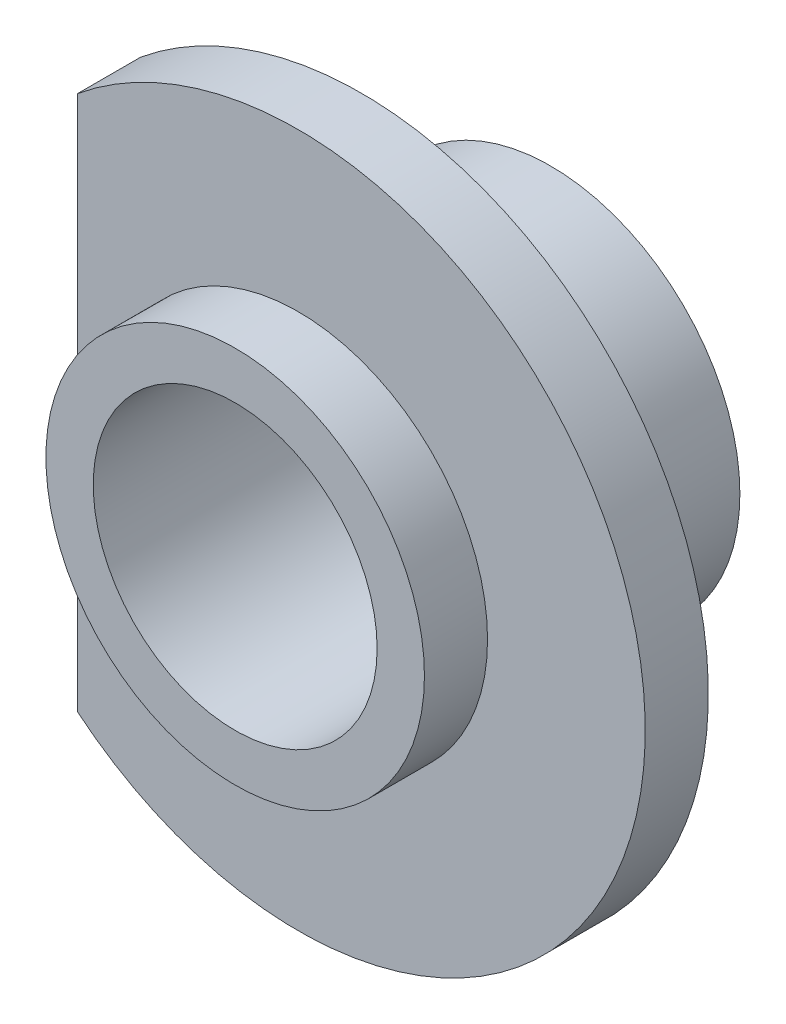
ISO-10303-21;
HEADER;
FILE_DESCRIPTION(('STEP AP214'),'2;1');
FILE_NAME('part.step','',(''),(''),'','','');
FILE_SCHEMA(('AUTOMOTIVE_DESIGN { 1 0 10303 214 1 1 1 1 }'));
ENDSEC;
DATA;
#1=APPLICATION_CONTEXT('core data for automotive mechanical design processes');
#2=APPLICATION_PROTOCOL_DEFINITION('international standard','automotive_design',2000,#1);
#3=PRODUCT_CONTEXT('',#1,'mechanical');
#4=PRODUCT('Part','Part','',(#3));
#5=PRODUCT_RELATED_PRODUCT_CATEGORY('part','',(#4));
#6=PRODUCT_DEFINITION_FORMATION('','',#4);
#7=PRODUCT_DEFINITION_CONTEXT('part definition',#1,'design');
#8=PRODUCT_DEFINITION('design','',#6,#7);
#9=PRODUCT_DEFINITION_SHAPE('','',#8);
#10=(LENGTH_UNIT() NAMED_UNIT(*) SI_UNIT(.MILLI.,.METRE.));
#11=(NAMED_UNIT(*) PLANE_ANGLE_UNIT() SI_UNIT($,.RADIAN.));
#12=(NAMED_UNIT(*) SI_UNIT($,.STERADIAN.) SOLID_ANGLE_UNIT());
#13=UNCERTAINTY_MEASURE_WITH_UNIT(LENGTH_MEASURE(1.E-05),#10,'distance_accuracy_value','');
#14=(GEOMETRIC_REPRESENTATION_CONTEXT(3) GLOBAL_UNCERTAINTY_ASSIGNED_CONTEXT((#13)) GLOBAL_UNIT_ASSIGNED_CONTEXT((#10,
#11,#12)) REPRESENTATION_CONTEXT('',''));
#15=CARTESIAN_POINT('',(0.,0.,0.));
#16=DIRECTION('',(0.,0.,1.));
#17=DIRECTION('',(1.,0.,0.));
#18=AXIS2_PLACEMENT_3D('',#15,#16,#17);
#19=CARTESIAN_POINT('',(0.,0.,2.));
#20=DIRECTION('',(0.,0.,1.));
#21=DIRECTION('',(1.,0.,0.));
#22=AXIS2_PLACEMENT_3D('',#19,#20,#21);
#23=PLANE('',#22);
#24=CARTESIAN_POINT('',(0.,0.,2.));
#25=DIRECTION('',(0.,0.,1.));
#26=DIRECTION('',(1.,0.,0.));
#27=AXIS2_PLACEMENT_3D('',#24,#25,#26);
#28=CIRCLE('',#27,11.);
#29=CARTESIAN_POINT('',(-7.,-8.48528137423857,2.));
#30=VERTEX_POINT('',#29);
#31=CARTESIAN_POINT('',(-7.,8.48528137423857,2.));
#32=VERTEX_POINT('',#31);
#33=EDGE_CURVE('E380',#30,#32,#28,.T.);
#34=ORIENTED_EDGE('',*,*,#33,.T.);
#35=DIRECTION('',(0.,-1.,0.));
#36=VECTOR('',#35,1.);
#37=CARTESIAN_POINT('',(-7.,8.48528137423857,2.));
#38=LINE('',#37,#36);
#39=EDGE_CURVE('E362',#32,#30,#38,.T.);
#40=ORIENTED_EDGE('',*,*,#39,.T.);
#41=EDGE_LOOP('',(#34,#40));
#42=FACE_BOUND('',#41,.T.);
#43=CARTESIAN_POINT('',(0.,0.,2.));
#44=DIRECTION('',(0.,0.,1.));
#45=DIRECTION('',(1.,0.,0.));
#46=AXIS2_PLACEMENT_3D('',#43,#44,#45);
#47=CIRCLE('',#46,6.);
#48=CARTESIAN_POINT('',(6.,0.,2.));
#49=VERTEX_POINT('',#48);
#50=EDGE_CURVE('E387',#49,#49,#47,.F.);
#51=ORIENTED_EDGE('',*,*,#50,.T.);
#52=EDGE_LOOP('',(#51));
#53=FACE_BOUND('',#52,.T.);
#54=ADVANCED_FACE('F348',(#42,#53),#23,.T.);
#55=CARTESIAN_POINT('',(0.,0.,0.));
#56=DIRECTION('',(0.,0.,1.));
#57=DIRECTION('',(1.,0.,0.));
#58=AXIS2_PLACEMENT_3D('',#55,#56,#57);
#59=PLANE('',#58);
#60=CARTESIAN_POINT('',(0.,0.,0.));
#61=DIRECTION('',(0.,0.,1.));
#62=DIRECTION('',(1.,0.,0.));
#63=AXIS2_PLACEMENT_3D('',#60,#61,#62);
#64=CIRCLE('',#63,11.);
#65=CARTESIAN_POINT('',(-7.,-8.48528137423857,0.));
#66=VERTEX_POINT('',#65);
#67=CARTESIAN_POINT('',(-7.,8.48528137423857,0.));
#68=VERTEX_POINT('',#67);
#69=EDGE_CURVE('E378',#66,#68,#64,.T.);
#70=ORIENTED_EDGE('',*,*,#69,.F.);
#71=DIRECTION('',(0.,-1.,0.));
#72=VECTOR('',#71,1.);
#73=CARTESIAN_POINT('',(-7.,8.48528137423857,0.));
#74=LINE('',#73,#72);
#75=EDGE_CURVE('E374',#68,#66,#74,.T.);
#76=ORIENTED_EDGE('',*,*,#75,.F.);
#77=EDGE_LOOP('',(#70,#76));
#78=FACE_BOUND('',#77,.T.);
#79=CARTESIAN_POINT('',(0.,0.,0.));
#80=DIRECTION('',(0.,0.,1.));
#81=DIRECTION('',(1.,0.,0.));
#82=AXIS2_PLACEMENT_3D('',#79,#80,#81);
#83=CIRCLE('',#82,6.);
#84=CARTESIAN_POINT('',(6.,0.,0.));
#85=VERTEX_POINT('',#84);
#86=EDGE_CURVE('E11',#85,#85,#83,.F.);
#87=ORIENTED_EDGE('',*,*,#86,.F.);
#88=EDGE_LOOP('',(#87));
#89=FACE_BOUND('',#88,.T.);
#90=ADVANCED_FACE('F375',(#78,#89),#59,.F.);
#91=CARTESIAN_POINT('',(0.,0.,2.));
#92=DIRECTION('',(0.,0.,-1.));
#93=DIRECTION('',(-1.,0.,0.));
#94=AXIS2_PLACEMENT_3D('',#91,#92,#93);
#95=CYLINDRICAL_SURFACE('',#94,11.);
#96=ORIENTED_EDGE('',*,*,#69,.T.);
#97=DIRECTION('',(0.,0.,-1.));
#98=VECTOR('',#97,1.);
#99=CARTESIAN_POINT('',(-7.,8.48528137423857,2.));
#100=LINE('',#99,#98);
#101=EDGE_CURVE('E356',#32,#68,#100,.T.);
#102=ORIENTED_EDGE('',*,*,#101,.F.);
#103=ORIENTED_EDGE('',*,*,#33,.F.);
#104=DIRECTION('',(0.,0.,-1.));
#105=VECTOR('',#104,1.);
#106=CARTESIAN_POINT('',(-7.,-8.48528137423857,2.));
#107=LINE('',#106,#105);
#108=EDGE_CURVE('E386',#30,#66,#107,.T.);
#109=ORIENTED_EDGE('',*,*,#108,.T.);
#110=EDGE_LOOP('',(#96,#102,#103,#109));
#111=FACE_BOUND('',#110,.T.);
#112=ADVANCED_FACE('F350',(#111),#95,.T.);
#113=CARTESIAN_POINT('',(-7.,8.48528137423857,2.));
#114=DIRECTION('',(1.,0.,0.));
#115=DIRECTION('',(0.,0.,-1.));
#116=AXIS2_PLACEMENT_3D('',#113,#114,#115);
#117=PLANE('',#116);
#118=ORIENTED_EDGE('',*,*,#75,.T.);
#119=ORIENTED_EDGE('',*,*,#108,.F.);
#120=ORIENTED_EDGE('',*,*,#39,.F.);
#121=ORIENTED_EDGE('',*,*,#101,.T.);
#122=EDGE_LOOP('',(#118,#119,#120,#121));
#123=FACE_BOUND('',#122,.T.);
#124=ADVANCED_FACE('F383',(#123),#117,.F.);
#125=CARTESIAN_POINT('',(0.,0.,-6.));
#126=DIRECTION('',(0.,0.,1.));
#127=DIRECTION('',(1.,0.,0.));
#128=AXIS2_PLACEMENT_3D('',#125,#126,#127);
#129=PLANE('',#128);
#130=CARTESIAN_POINT('',(0.,0.,-6.));
#131=DIRECTION('',(0.,0.,1.));
#132=DIRECTION('',(1.,0.,0.));
#133=AXIS2_PLACEMENT_3D('',#130,#131,#132);
#134=CIRCLE('',#133,4.5);
#135=CARTESIAN_POINT('',(4.5,0.,-6.));
#136=VERTEX_POINT('',#135);
#137=EDGE_CURVE('E412',#136,#136,#134,.T.);
#138=ORIENTED_EDGE('',*,*,#137,.T.);
#139=EDGE_LOOP('',(#138));
#140=FACE_BOUND('',#139,.T.);
#141=CARTESIAN_POINT('',(0.,0.,-6.));
#142=DIRECTION('',(0.,0.,1.));
#143=DIRECTION('',(1.,0.,0.));
#144=AXIS2_PLACEMENT_3D('',#141,#142,#143);
#145=CIRCLE('',#144,6.);
#146=CARTESIAN_POINT('',(6.,0.,-6.));
#147=VERTEX_POINT('',#146);
#148=EDGE_CURVE('E410',#147,#147,#145,.T.);
#149=ORIENTED_EDGE('',*,*,#148,.F.);
#150=EDGE_LOOP('',(#149));
#151=FACE_BOUND('',#150,.T.);
#152=ADVANCED_FACE('F432',(#140,#151),#129,.F.);
#153=CARTESIAN_POINT('',(0.,0.,4.));
#154=DIRECTION('',(0.,0.,-1.));
#155=DIRECTION('',(-1.,0.,0.));
#156=AXIS2_PLACEMENT_3D('',#153,#154,#155);
#157=CYLINDRICAL_SURFACE('',#156,6.);
#158=ORIENTED_EDGE('',*,*,#148,.T.);
#159=EDGE_LOOP('',(#158));
#160=FACE_BOUND('',#159,.T.);
#161=ORIENTED_EDGE('',*,*,#86,.T.);
#162=EDGE_LOOP('',(#161));
#163=FACE_BOUND('',#162,.T.);
#164=ADVANCED_FACE('F405',(#160,#163),#157,.T.);
#165=ORIENTED_EDGE('',*,*,#50,.F.);
#166=EDGE_LOOP('',(#165));
#167=FACE_BOUND('',#166,.T.);
#168=CARTESIAN_POINT('',(0.,0.,4.));
#169=DIRECTION('',(0.,0.,1.));
#170=DIRECTION('',(1.,0.,0.));
#171=AXIS2_PLACEMENT_3D('',#168,#169,#170);
#172=CIRCLE('',#171,6.);
#173=CARTESIAN_POINT('',(6.,0.,4.));
#174=VERTEX_POINT('',#173);
#175=EDGE_CURVE('E390',#174,#174,#172,.T.);
#176=ORIENTED_EDGE('',*,*,#175,.F.);
#177=EDGE_LOOP('',(#176));
#178=FACE_BOUND('',#177,.T.);
#179=ADVANCED_FACE('F401',(#167,#178),#157,.T.);
#180=CARTESIAN_POINT('',(0.,0.,4.));
#181=DIRECTION('',(0.,0.,1.));
#182=DIRECTION('',(1.,0.,0.));
#183=AXIS2_PLACEMENT_3D('',#180,#181,#182);
#184=PLANE('',#183);
#185=CARTESIAN_POINT('',(0.,0.,4.));
#186=DIRECTION('',(0.,0.,1.));
#187=DIRECTION('',(1.,0.,0.));
#188=AXIS2_PLACEMENT_3D('',#185,#186,#187);
#189=CIRCLE('',#188,4.5);
#190=CARTESIAN_POINT('',(4.5,0.,4.));
#191=VERTEX_POINT('',#190);
#192=EDGE_CURVE('E417',#191,#191,#189,.T.);
#193=ORIENTED_EDGE('',*,*,#192,.F.);
#194=EDGE_LOOP('',(#193));
#195=FACE_BOUND('',#194,.T.);
#196=ORIENTED_EDGE('',*,*,#175,.T.);
#197=EDGE_LOOP('',(#196));
#198=FACE_BOUND('',#197,.T.);
#199=ADVANCED_FACE('F404',(#195,#198),#184,.T.);
#200=CARTESIAN_POINT('',(0.,0.,-6.));
#201=DIRECTION('',(0.,0.,1.));
#202=DIRECTION('',(1.,0.,0.));
#203=AXIS2_PLACEMENT_3D('',#200,#201,#202);
#204=CYLINDRICAL_SURFACE('',#203,4.5);
#205=ORIENTED_EDGE('',*,*,#137,.F.);
#206=EDGE_LOOP('',(#205));
#207=FACE_BOUND('',#206,.T.);
#208=ORIENTED_EDGE('',*,*,#192,.T.);
#209=EDGE_LOOP('',(#208));
#210=FACE_BOUND('',#209,.T.);
#211=ADVANCED_FACE('F421',(#207,#210),#204,.F.);
#212=CLOSED_SHELL('',(#54,#90,#112,#124,#152,#164,#179,#199,#211));
#213=MANIFOLD_SOLID_BREP('B2',#212);
#214=ADVANCED_BREP_SHAPE_REPRESENTATION('',(#18,#213),#14);
#215=SHAPE_DEFINITION_REPRESENTATION(#9,#214);
ENDSEC;
END-ISO-10303-21;
